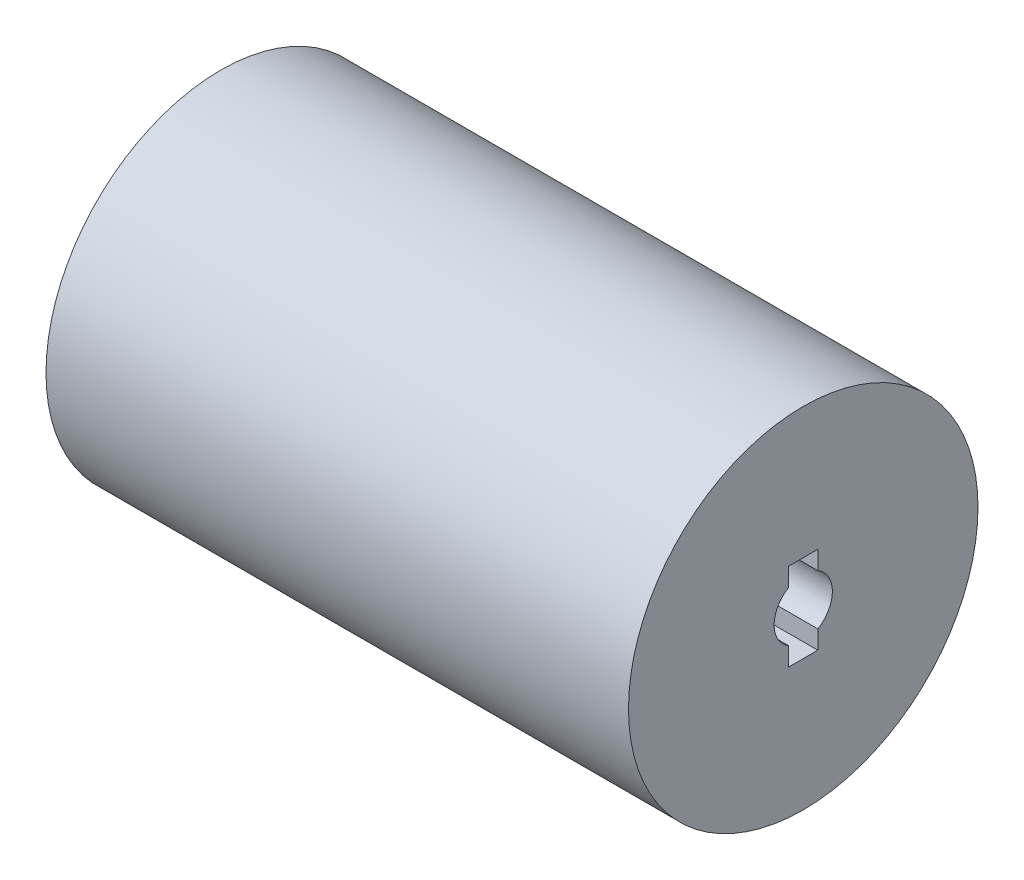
ISO-10303-21;
HEADER;
FILE_DESCRIPTION(('STEP AP214'),'2;1');
FILE_NAME('part.step','',(''),(''),'','','');
FILE_SCHEMA(('AUTOMOTIVE_DESIGN { 1 0 10303 214 1 1 1 1 }'));
ENDSEC;
DATA;
#1=APPLICATION_CONTEXT('core data for automotive mechanical design processes');
#2=APPLICATION_PROTOCOL_DEFINITION('international standard','automotive_design',2000,#1);
#3=PRODUCT_CONTEXT('',#1,'mechanical');
#4=PRODUCT('Part','Part','',(#3));
#5=PRODUCT_RELATED_PRODUCT_CATEGORY('part','',(#4));
#6=PRODUCT_DEFINITION_FORMATION('','',#4);
#7=PRODUCT_DEFINITION_CONTEXT('part definition',#1,'design');
#8=PRODUCT_DEFINITION('design','',#6,#7);
#9=PRODUCT_DEFINITION_SHAPE('','',#8);
#10=(LENGTH_UNIT() NAMED_UNIT(*) SI_UNIT(.MILLI.,.METRE.));
#11=(NAMED_UNIT(*) PLANE_ANGLE_UNIT() SI_UNIT($,.RADIAN.));
#12=(NAMED_UNIT(*) SI_UNIT($,.STERADIAN.) SOLID_ANGLE_UNIT());
#13=UNCERTAINTY_MEASURE_WITH_UNIT(LENGTH_MEASURE(1.E-05),#10,'distance_accuracy_value','');
#14=(GEOMETRIC_REPRESENTATION_CONTEXT(3) GLOBAL_UNCERTAINTY_ASSIGNED_CONTEXT((#13)) GLOBAL_UNIT_ASSIGNED_CONTEXT((#10,
#11,#12)) REPRESENTATION_CONTEXT('',''));
#15=CARTESIAN_POINT('',(0.,0.,0.));
#16=DIRECTION('',(0.,0.,1.));
#17=DIRECTION('',(1.,0.,0.));
#18=AXIS2_PLACEMENT_3D('',#15,#16,#17);
#19=CARTESIAN_POINT('',(-1.2E-05,0.,0.));
#20=DIRECTION('',(1.,0.,0.));
#21=DIRECTION('',(0.,0.,-1.));
#22=AXIS2_PLACEMENT_3D('',#19,#20,#21);
#23=CYLINDRICAL_SURFACE('',#22,5.);
#24=CARTESIAN_POINT('',(100.,0.,0.));
#25=DIRECTION('',(1.,0.,0.));
#26=DIRECTION('',(0.,0.,-1.));
#27=AXIS2_PLACEMENT_3D('',#24,#25,#26);
#28=CIRCLE('',#27,5.);
#29=CARTESIAN_POINT('',(100.,4.33012701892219,2.5));
#30=VERTEX_POINT('',#29);
#31=CARTESIAN_POINT('',(100.,-4.33012701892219,2.5));
#32=VERTEX_POINT('',#31);
#33=EDGE_CURVE('E129',#30,#32,#28,.T.);
#34=ORIENTED_EDGE('',*,*,#33,.T.);
#35=DIRECTION('',(1.,0.,0.));
#36=VECTOR('',#35,1.);
#37=CARTESIAN_POINT('',(-1.2E-05,-4.33012701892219,2.5));
#38=LINE('',#37,#36);
#39=CARTESIAN_POINT('',(0.,-4.33012701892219,2.5));
#40=VERTEX_POINT('',#39);
#41=EDGE_CURVE('E167',#32,#40,#38,.F.);
#42=ORIENTED_EDGE('',*,*,#41,.T.);
#43=CARTESIAN_POINT('',(0.,0.,0.));
#44=DIRECTION('',(1.,0.,0.));
#45=DIRECTION('',(0.,0.,-1.));
#46=AXIS2_PLACEMENT_3D('',#43,#44,#45);
#47=CIRCLE('',#46,5.);
#48=CARTESIAN_POINT('',(0.,4.33012701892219,2.5));
#49=VERTEX_POINT('',#48);
#50=EDGE_CURVE('E158',#49,#40,#47,.T.);
#51=ORIENTED_EDGE('',*,*,#50,.F.);
#52=DIRECTION('',(1.,0.,0.));
#53=VECTOR('',#52,1.);
#54=CARTESIAN_POINT('',(-1.2E-05,4.33012701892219,2.5));
#55=LINE('',#54,#53);
#56=EDGE_CURVE('E165',#49,#30,#55,.T.);
#57=ORIENTED_EDGE('',*,*,#56,.T.);
#58=EDGE_LOOP('',(#34,#42,#51,#57));
#59=FACE_BOUND('',#58,.T.);
#60=ADVANCED_FACE('F38',(#59),#23,.F.);
#61=CARTESIAN_POINT('',(100.,0.,0.));
#62=DIRECTION('',(-1.,0.,0.));
#63=DIRECTION('',(0.,0.,1.));
#64=AXIS2_PLACEMENT_3D('',#61,#62,#63);
#65=CYLINDRICAL_SURFACE('',#64,30.);
#66=CARTESIAN_POINT('',(100.,0.,0.));
#67=DIRECTION('',(1.,0.,0.));
#68=DIRECTION('',(0.,0.,-1.));
#69=AXIS2_PLACEMENT_3D('',#66,#67,#68);
#70=CIRCLE('',#69,30.);
#71=CARTESIAN_POINT('',(100.,0.,-30.));
#72=VERTEX_POINT('',#71);
#73=EDGE_CURVE('E151',#72,#72,#70,.T.);
#74=ORIENTED_EDGE('',*,*,#73,.F.);
#75=EDGE_LOOP('',(#74));
#76=FACE_BOUND('',#75,.T.);
#77=CARTESIAN_POINT('',(0.,0.,0.));
#78=DIRECTION('',(1.,0.,0.));
#79=DIRECTION('',(0.,0.,-1.));
#80=AXIS2_PLACEMENT_3D('',#77,#78,#79);
#81=CIRCLE('',#80,30.);
#82=CARTESIAN_POINT('',(0.,0.,-30.));
#83=VERTEX_POINT('',#82);
#84=EDGE_CURVE('E155',#83,#83,#81,.T.);
#85=ORIENTED_EDGE('',*,*,#84,.T.);
#86=EDGE_LOOP('',(#85));
#87=FACE_BOUND('',#86,.T.);
#88=ADVANCED_FACE('F40',(#76,#87),#65,.T.);
#89=CARTESIAN_POINT('',(100.,0.,0.));
#90=DIRECTION('',(1.,0.,0.));
#91=DIRECTION('',(0.,0.,-1.));
#92=AXIS2_PLACEMENT_3D('',#89,#90,#91);
#93=PLANE('',#92);
#94=DIRECTION('',(0.,1.,0.));
#95=VECTOR('',#94,1.);
#96=CARTESIAN_POINT('',(100.,-7.5,2.5));
#97=LINE('',#96,#95);
#98=CARTESIAN_POINT('',(100.,-7.5,2.5));
#99=VERTEX_POINT('',#98);
#100=EDGE_CURVE('E122',#99,#32,#97,.T.);
#101=ORIENTED_EDGE('',*,*,#100,.T.);
#102=ORIENTED_EDGE('',*,*,#33,.F.);
#103=CARTESIAN_POINT('',(100.,7.5,2.5));
#104=VERTEX_POINT('',#103);
#105=EDGE_CURVE('E107',#30,#104,#97,.T.);
#106=ORIENTED_EDGE('',*,*,#105,.T.);
#107=DIRECTION('',(0.,0.,-1.));
#108=VECTOR('',#107,1.);
#109=CARTESIAN_POINT('',(100.,7.5,-2.5));
#110=LINE('',#109,#108);
#111=CARTESIAN_POINT('',(100.,7.5,-2.5));
#112=VERTEX_POINT('',#111);
#113=EDGE_CURVE('E117',#104,#112,#110,.T.);
#114=ORIENTED_EDGE('',*,*,#113,.T.);
#115=DIRECTION('',(0.,-1.,0.));
#116=VECTOR('',#115,1.);
#117=CARTESIAN_POINT('',(100.,-7.5,-2.5));
#118=LINE('',#117,#116);
#119=CARTESIAN_POINT('',(100.,4.33012701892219,-2.5));
#120=VERTEX_POINT('',#119);
#121=EDGE_CURVE('E132',#112,#120,#118,.T.);
#122=ORIENTED_EDGE('',*,*,#121,.T.);
#123=CARTESIAN_POINT('',(100.,-4.33012701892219,-2.5));
#124=VERTEX_POINT('',#123);
#125=EDGE_CURVE('E148',#124,#120,#28,.T.);
#126=ORIENTED_EDGE('',*,*,#125,.F.);
#127=CARTESIAN_POINT('',(100.,-7.5,-2.5));
#128=VERTEX_POINT('',#127);
#129=EDGE_CURVE('E61',#124,#128,#118,.T.);
#130=ORIENTED_EDGE('',*,*,#129,.T.);
#131=DIRECTION('',(0.,0.,1.));
#132=VECTOR('',#131,1.);
#133=CARTESIAN_POINT('',(100.,-7.5,-2.5));
#134=LINE('',#133,#132);
#135=EDGE_CURVE('E114',#128,#99,#134,.T.);
#136=ORIENTED_EDGE('',*,*,#135,.T.);
#137=EDGE_LOOP('',(#101,#102,#106,#114,#122,#126,#130,#136));
#138=FACE_BOUND('',#137,.T.);
#139=ORIENTED_EDGE('',*,*,#73,.T.);
#140=EDGE_LOOP('',(#139));
#141=FACE_BOUND('',#140,.T.);
#142=ADVANCED_FACE('F126',(#138,#141),#93,.T.);
#143=CARTESIAN_POINT('',(0.,0.,0.));
#144=DIRECTION('',(1.,0.,0.));
#145=DIRECTION('',(0.,0.,-1.));
#146=AXIS2_PLACEMENT_3D('',#143,#144,#145);
#147=PLANE('',#146);
#148=ORIENTED_EDGE('',*,*,#50,.T.);
#149=DIRECTION('',(0.,-1.,0.));
#150=VECTOR('',#149,1.);
#151=CARTESIAN_POINT('',(0.,0.,2.5));
#152=LINE('',#151,#150);
#153=CARTESIAN_POINT('',(0.,-7.5,2.5));
#154=VERTEX_POINT('',#153);
#155=EDGE_CURVE('E147',#40,#154,#152,.T.);
#156=ORIENTED_EDGE('',*,*,#155,.T.);
#157=DIRECTION('',(0.,0.,-1.));
#158=VECTOR('',#157,1.);
#159=CARTESIAN_POINT('',(0.,-7.5,0.));
#160=LINE('',#159,#158);
#161=CARTESIAN_POINT('',(0.,-7.5,-2.5));
#162=VERTEX_POINT('',#161);
#163=EDGE_CURVE('E11',#154,#162,#160,.T.);
#164=ORIENTED_EDGE('',*,*,#163,.T.);
#165=DIRECTION('',(0.,1.,0.));
#166=VECTOR('',#165,1.);
#167=CARTESIAN_POINT('',(0.,0.,-2.5));
#168=LINE('',#167,#166);
#169=CARTESIAN_POINT('',(0.,-4.33012701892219,-2.5));
#170=VERTEX_POINT('',#169);
#171=EDGE_CURVE('E139',#162,#170,#168,.T.);
#172=ORIENTED_EDGE('',*,*,#171,.T.);
#173=CARTESIAN_POINT('',(0.,4.33012701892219,-2.5));
#174=VERTEX_POINT('',#173);
#175=EDGE_CURVE('E159',#170,#174,#47,.T.);
#176=ORIENTED_EDGE('',*,*,#175,.T.);
#177=CARTESIAN_POINT('',(0.,7.5,-2.5));
#178=VERTEX_POINT('',#177);
#179=EDGE_CURVE('E53',#174,#178,#168,.T.);
#180=ORIENTED_EDGE('',*,*,#179,.T.);
#181=DIRECTION('',(0.,0.,1.));
#182=VECTOR('',#181,1.);
#183=CARTESIAN_POINT('',(0.,7.5,0.));
#184=LINE('',#183,#182);
#185=CARTESIAN_POINT('',(0.,7.5,2.5));
#186=VERTEX_POINT('',#185);
#187=EDGE_CURVE('E46',#178,#186,#184,.T.);
#188=ORIENTED_EDGE('',*,*,#187,.T.);
#189=EDGE_CURVE('E110',#186,#49,#152,.T.);
#190=ORIENTED_EDGE('',*,*,#189,.T.);
#191=EDGE_LOOP('',(#148,#156,#164,#172,#176,#180,#188,#190));
#192=FACE_BOUND('',#191,.T.);
#193=ORIENTED_EDGE('',*,*,#84,.F.);
#194=EDGE_LOOP('',(#193));
#195=FACE_BOUND('',#194,.T.);
#196=ADVANCED_FACE('F171',(#192,#195),#147,.F.);
#197=ORIENTED_EDGE('',*,*,#125,.T.);
#198=DIRECTION('',(1.,0.,0.));
#199=VECTOR('',#198,1.);
#200=CARTESIAN_POINT('',(-1.2E-05,4.33012701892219,-2.5));
#201=LINE('',#200,#199);
#202=EDGE_CURVE('E163',#120,#174,#201,.F.);
#203=ORIENTED_EDGE('',*,*,#202,.T.);
#204=ORIENTED_EDGE('',*,*,#175,.F.);
#205=DIRECTION('',(1.,0.,0.));
#206=VECTOR('',#205,1.);
#207=CARTESIAN_POINT('',(-1.2E-05,-4.33012701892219,-2.5));
#208=LINE('',#207,#206);
#209=EDGE_CURVE('E154',#170,#124,#208,.T.);
#210=ORIENTED_EDGE('',*,*,#209,.T.);
#211=EDGE_LOOP('',(#197,#203,#204,#210));
#212=FACE_BOUND('',#211,.T.);
#213=ADVANCED_FACE('F177',(#212),#23,.F.);
#214=CARTESIAN_POINT('',(100.,-7.5,-2.5));
#215=DIRECTION('',(0.,0.,-1.));
#216=DIRECTION('',(-1.,0.,0.));
#217=AXIS2_PLACEMENT_3D('',#214,#215,#216);
#218=PLANE('',#217);
#219=DIRECTION('',(-1.,0.,0.));
#220=VECTOR('',#219,1.);
#221=CARTESIAN_POINT('',(100.,-7.5,-2.5));
#222=LINE('',#221,#220);
#223=EDGE_CURVE('E140',#128,#162,#222,.T.);
#224=ORIENTED_EDGE('',*,*,#223,.F.);
#225=ORIENTED_EDGE('',*,*,#129,.F.);
#226=ORIENTED_EDGE('',*,*,#209,.F.);
#227=ORIENTED_EDGE('',*,*,#171,.F.);
#228=EDGE_LOOP('',(#224,#225,#226,#227));
#229=FACE_BOUND('',#228,.T.);
#230=ADVANCED_FACE('F179',(#229),#218,.F.);
#231=CARTESIAN_POINT('',(100.,-7.5,2.5));
#232=DIRECTION('',(0.,0.,1.));
#233=DIRECTION('',(1.,0.,0.));
#234=AXIS2_PLACEMENT_3D('',#231,#232,#233);
#235=PLANE('',#234);
#236=ORIENTED_EDGE('',*,*,#41,.F.);
#237=ORIENTED_EDGE('',*,*,#100,.F.);
#238=DIRECTION('',(-1.,0.,0.));
#239=VECTOR('',#238,1.);
#240=CARTESIAN_POINT('',(100.,-7.5,2.5));
#241=LINE('',#240,#239);
#242=EDGE_CURVE('E136',#99,#154,#241,.T.);
#243=ORIENTED_EDGE('',*,*,#242,.T.);
#244=ORIENTED_EDGE('',*,*,#155,.F.);
#245=EDGE_LOOP('',(#236,#237,#243,#244));
#246=FACE_BOUND('',#245,.T.);
#247=ADVANCED_FACE('F186',(#246),#235,.F.);
#248=CARTESIAN_POINT('',(100.,-7.5,-2.5));
#249=DIRECTION('',(0.,-1.,0.));
#250=DIRECTION('',(0.,0.,-1.));
#251=AXIS2_PLACEMENT_3D('',#248,#249,#250);
#252=PLANE('',#251);
#253=ORIENTED_EDGE('',*,*,#242,.F.);
#254=ORIENTED_EDGE('',*,*,#135,.F.);
#255=ORIENTED_EDGE('',*,*,#223,.T.);
#256=ORIENTED_EDGE('',*,*,#163,.F.);
#257=EDGE_LOOP('',(#253,#254,#255,#256));
#258=FACE_BOUND('',#257,.T.);
#259=ADVANCED_FACE('F182',(#258),#252,.F.);
#260=CARTESIAN_POINT('',(100.,7.5,-2.5));
#261=DIRECTION('',(0.,1.,0.));
#262=DIRECTION('',(0.,0.,1.));
#263=AXIS2_PLACEMENT_3D('',#260,#261,#262);
#264=PLANE('',#263);
#265=DIRECTION('',(-1.,0.,0.));
#266=VECTOR('',#265,1.);
#267=CARTESIAN_POINT('',(100.,7.5,-2.5));
#268=LINE('',#267,#266);
#269=EDGE_CURVE('E113',#112,#178,#268,.T.);
#270=ORIENTED_EDGE('',*,*,#269,.F.);
#271=ORIENTED_EDGE('',*,*,#113,.F.);
#272=DIRECTION('',(-1.,0.,0.));
#273=VECTOR('',#272,1.);
#274=CARTESIAN_POINT('',(100.,7.5,2.5));
#275=LINE('',#274,#273);
#276=EDGE_CURVE('E103',#104,#186,#275,.T.);
#277=ORIENTED_EDGE('',*,*,#276,.T.);
#278=ORIENTED_EDGE('',*,*,#187,.F.);
#279=EDGE_LOOP('',(#270,#271,#277,#278));
#280=FACE_BOUND('',#279,.T.);
#281=ADVANCED_FACE('F118',(#280),#264,.F.);
#282=ORIENTED_EDGE('',*,*,#276,.F.);
#283=ORIENTED_EDGE('',*,*,#105,.F.);
#284=ORIENTED_EDGE('',*,*,#56,.F.);
#285=ORIENTED_EDGE('',*,*,#189,.F.);
#286=EDGE_LOOP('',(#282,#283,#284,#285));
#287=FACE_BOUND('',#286,.T.);
#288=ADVANCED_FACE('F105',(#287),#235,.F.);
#289=ORIENTED_EDGE('',*,*,#202,.F.);
#290=ORIENTED_EDGE('',*,*,#121,.F.);
#291=ORIENTED_EDGE('',*,*,#269,.T.);
#292=ORIENTED_EDGE('',*,*,#179,.F.);
#293=EDGE_LOOP('',(#289,#290,#291,#292));
#294=FACE_BOUND('',#293,.T.);
#295=ADVANCED_FACE('F174',(#294),#218,.F.);
#296=CLOSED_SHELL('',(#60,#88,#142,#196,#213,#230,#247,#259,#281,#288,#295));
#297=MANIFOLD_SOLID_BREP('B2',#296);
#298=ADVANCED_BREP_SHAPE_REPRESENTATION('',(#18,#297),#14);
#299=SHAPE_DEFINITION_REPRESENTATION(#9,#298);
ENDSEC;
END-ISO-10303-21;
